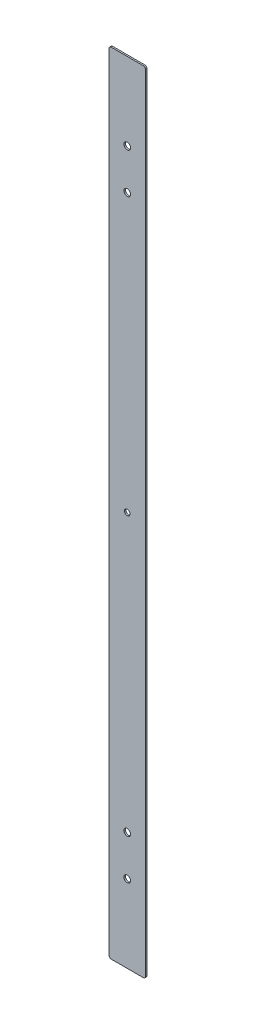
from build123d import *

# Parameters (mm, degrees)
SKIZZE1_W                       = 36
SKIZZE1_H                       = 784
AUFSATZ_LINEAR_AUSTRAGEN1_DEPTH = 1.5
DURCHGANGSLOCH_F_R_M61_D        = 6.6
VERRUNDUNG1_R                   = 2
DURCHGANGSLOCH_F_R_M51_D        = 5.5


with BuildPart() as part:
    # Skizze1 → Aufsatz-Linear austragen1 (new body)
    with BuildSketch(Plane.XY):
        Rectangle(SKIZZE1_W, SKIZZE1_H)
    extrude(amount=AUFSATZ_LINEAR_AUSTRAGEN1_DEPTH)

    # Durchgangsloch f_r M61 (through all)
    with Locations(Plane.XY.offset(1.5)):
        with Locations((0, 315), (0, 275), (0, -275), (0, -315)):
            Hole(DURCHGANGSLOCH_F_R_M61_D / 2)

    # Verrundung1
    verrundung1_edges = [part.edges().sort_by_distance(p)[0] for p in [
        (18, -392, 0.75),
        (-18, -392, 0.75),
        (-18, 392, 0.75),
        (18, 392, 0.75),
    ]]
    fillet(verrundung1_edges, radius=VERRUNDUNG1_R)

    # Durchgangsloch f_r M51 (through all)
    with Locations(Plane.XY.offset(1.5)):
        with Locations((0, 0)):
            Hole(DURCHGANGSLOCH_F_R_M51_D / 2)


solid = part.part
